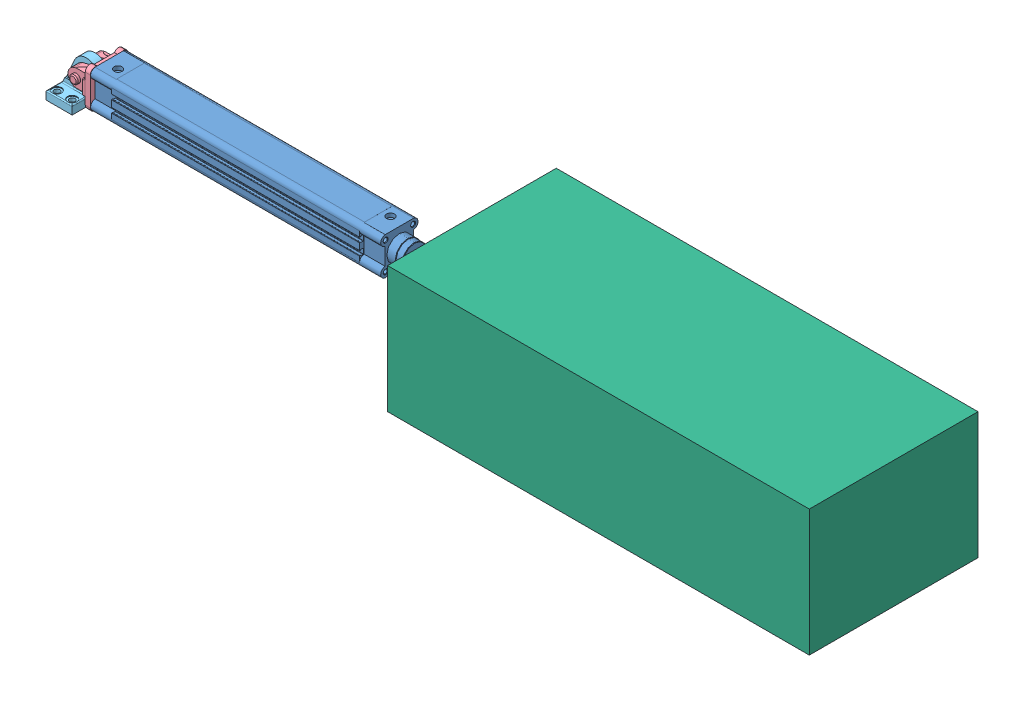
SolidWorks assembly Hub1.SLDASM, configuration Standard (file format 3400). Lengths in mm.
Overall size (979.5 150 200).
7 component instances, 6 part files, 8 mates.
Components (placement in the parent):
- FESTO DNC-32-250-PPV-1: FESTO DNC-32-250-PPV.SLDASM [Animation-_flexible1] at (404 32 0) size (470.64 54.5 51) (flexible)
  - FESTO   DNC-32-250-PPV Cyl-1: FESTO   DNC-32-250-PPV Cyl.sldprt [Standard] at (-26 0 0) x (-1 0 0) z (0 0 -1) size (366 44.5 44.5)
  - Kolbenstange DNC-32-250-PPV-1: Kolbenstange DNC-32-250-PPV.SLDPRT [Standard] at origin size (282 12 12)
  - FESTO   SG-M10x1,25-1: FESTO   SG-M10x1,25.SLDPRT [Standard] x (0 0 -1) z (1 0 0) size (30 20 51.14)
  - FESTO   SNC-32-1: FESTO   SNC-32.SLDPRT [Standard] at (-370 0 0) x (0 0 1) z (-1 0 0) size (45 45 32)
  - FESTO   LSNG-32-1: FESTO   LSNG-32.sldprt [Standard] at (-404 -32 0) x (-1 0 0) z (0 0 -1) size (42.5 47 51)
- Block1-1: Block1.SLDPRT [Standard] at (714 32 0) size (530 150 200)
Mates (geometry in assembly coordinates):
- Deckungsgleich1: coincident: plane of ?; plane of assembly
- Deckungsgleich2: coincident: unknown of FESTO DNC-32-250-PPV-1/FESTO   LSNG-32-1
- Deckungsgleich3: coincident: unknown of FESTO DNC-32-250-PPV-1/FESTO   LSNG-32-1
- Konzentrisch1: concentric: cylinder of FESTO DNC-32-250-PPV-1/FESTO   SG-M10x1,25-1
- Deckungsgleich4: coincident: plane of ?; plane of ?
- Deckungsgleich10: coincident: line of ?; plane of assembly
- Abstand1: distance = 964 mm: line of ?; plane of assembly
- Abstand2: distance = 75 mm: axis of FESTO DNC-32-250-PPV-1/FESTO   SG-M10x1,25-1
